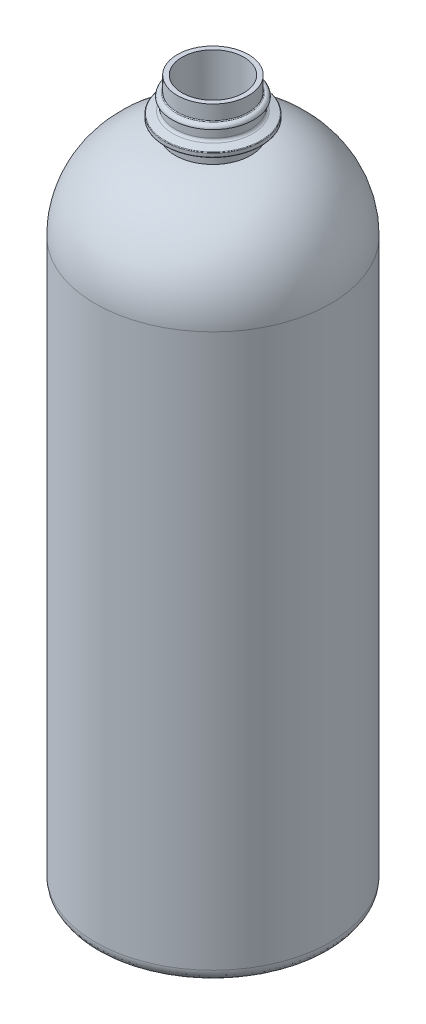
ISO-10303-21;
HEADER;
FILE_DESCRIPTION(('STEP AP214'),'2;1');
FILE_NAME('part.step','',(''),(''),'','','');
FILE_SCHEMA(('AUTOMOTIVE_DESIGN { 1 0 10303 214 1 1 1 1 }'));
ENDSEC;
DATA;
#1=APPLICATION_CONTEXT('core data for automotive mechanical design processes');
#2=APPLICATION_PROTOCOL_DEFINITION('international standard','automotive_design',2000,#1);
#3=PRODUCT_CONTEXT('',#1,'mechanical');
#4=PRODUCT('Part','Part','',(#3));
#5=PRODUCT_RELATED_PRODUCT_CATEGORY('part','',(#4));
#6=PRODUCT_DEFINITION_FORMATION('','',#4);
#7=PRODUCT_DEFINITION_CONTEXT('part definition',#1,'design');
#8=PRODUCT_DEFINITION('design','',#6,#7);
#9=PRODUCT_DEFINITION_SHAPE('','',#8);
#10=(LENGTH_UNIT() NAMED_UNIT(*) SI_UNIT(.MILLI.,.METRE.));
#11=(NAMED_UNIT(*) PLANE_ANGLE_UNIT() SI_UNIT($,.RADIAN.));
#12=(NAMED_UNIT(*) SI_UNIT($,.STERADIAN.) SOLID_ANGLE_UNIT());
#13=UNCERTAINTY_MEASURE_WITH_UNIT(LENGTH_MEASURE(1.E-05),#10,'distance_accuracy_value','');
#14=(GEOMETRIC_REPRESENTATION_CONTEXT(3) GLOBAL_UNCERTAINTY_ASSIGNED_CONTEXT((#13)) GLOBAL_UNIT_ASSIGNED_CONTEXT((#10,
#11,#12)) REPRESENTATION_CONTEXT('',''));
#15=CARTESIAN_POINT('',(0.,0.,0.));
#16=DIRECTION('',(0.,0.,1.));
#17=DIRECTION('',(1.,0.,0.));
#18=AXIS2_PLACEMENT_3D('',#15,#16,#17);
#19=CARTESIAN_POINT('',(0.,233.76763057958,0.));
#20=DIRECTION('',(0.,1.,0.));
#21=DIRECTION('',(-1.,0.,0.));
#22=AXIS2_PLACEMENT_3D('',#19,#20,#21);
#23=TOROIDAL_SURFACE('',#22,14.,0.999999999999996);
#24=CARTESIAN_POINT('',(0.,232.802611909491,0.));
#25=DIRECTION('',(0.,1.,0.));
#26=DIRECTION('',(-1.,0.,0.));
#27=AXIS2_PLACEMENT_3D('',#24,#25,#26);
#28=CIRCLE('',#27,13.7378188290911);
#29=CARTESIAN_POINT('',(-13.7378188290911,232.802611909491,0.));
#30=VERTEX_POINT('',#29);
#31=EDGE_CURVE('E147',#30,#30,#28,.T.);
#32=ORIENTED_EDGE('',*,*,#31,.T.);
#33=EDGE_LOOP('',(#32));
#34=FACE_BOUND('',#33,.T.);
#35=CARTESIAN_POINT('',(0.,233.76763057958,0.));
#36=DIRECTION('',(0.,1.,0.));
#37=DIRECTION('',(-1.,0.,0.));
#38=AXIS2_PLACEMENT_3D('',#35,#36,#37);
#39=CIRCLE('',#38,13.);
#40=CARTESIAN_POINT('',(-13.,233.76763057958,0.));
#41=VERTEX_POINT('',#40);
#42=EDGE_CURVE('E144',#41,#41,#39,.T.);
#43=ORIENTED_EDGE('',*,*,#42,.F.);
#44=EDGE_LOOP('',(#43));
#45=FACE_BOUND('',#44,.T.);
#46=ADVANCED_FACE('F43',(#34,#45),#23,.F.);
#47=CARTESIAN_POINT('',(0.,232.802611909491,0.));
#48=DIRECTION('',(0.,-1.,0.));
#49=DIRECTION('',(1.,0.,0.));
#50=AXIS2_PLACEMENT_3D('',#47,#48,#49);
#51=CONICAL_SURFACE('',#50,13.7378188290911,1.3055145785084);
#52=CARTESIAN_POINT('',(0.,232.075113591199,0.));
#53=DIRECTION('',(0.,1.,0.));
#54=DIRECTION('',(-1.,0.,0.));
#55=AXIS2_PLACEMENT_3D('',#52,#53,#54);
#56=CIRCLE('',#55,16.4155452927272);
#57=CARTESIAN_POINT('',(-16.4155452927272,232.075113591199,0.));
#58=VERTEX_POINT('',#57);
#59=EDGE_CURVE('E150',#58,#58,#56,.T.);
#60=ORIENTED_EDGE('',*,*,#59,.T.);
#61=EDGE_LOOP('',(#60));
#62=FACE_BOUND('',#61,.T.);
#63=ORIENTED_EDGE('',*,*,#31,.F.);
#64=EDGE_LOOP('',(#63));
#65=FACE_BOUND('',#64,.T.);
#66=ADVANCED_FACE('F219',(#62,#65),#51,.T.);
#67=CARTESIAN_POINT('',(0.,231.833858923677,0.));
#68=DIRECTION('',(0.,1.,0.));
#69=DIRECTION('',(-1.,0.,0.));
#70=AXIS2_PLACEMENT_3D('',#67,#68,#69);
#71=TOROIDAL_SURFACE('',#70,16.35,0.249999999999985);
#72=CARTESIAN_POINT('',(0.,231.833858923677,0.));
#73=DIRECTION('',(0.,1.,0.));
#74=DIRECTION('',(-1.,0.,0.));
#75=AXIS2_PLACEMENT_3D('',#72,#73,#74);
#76=CIRCLE('',#75,16.6);
#77=CARTESIAN_POINT('',(-16.6,231.833858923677,0.));
#78=VERTEX_POINT('',#77);
#79=EDGE_CURVE('E153',#78,#78,#76,.T.);
#80=ORIENTED_EDGE('',*,*,#79,.T.);
#81=EDGE_LOOP('',(#80));
#82=FACE_BOUND('',#81,.T.);
#83=ORIENTED_EDGE('',*,*,#59,.F.);
#84=EDGE_LOOP('',(#83));
#85=FACE_BOUND('',#84,.T.);
#86=ADVANCED_FACE('F223',(#82,#85),#71,.T.);
#87=CARTESIAN_POINT('',(0.,243.425,0.));
#88=DIRECTION('',(0.,1.,0.));
#89=DIRECTION('',(-1.,0.,0.));
#90=AXIS2_PLACEMENT_3D('',#87,#88,#89);
#91=CYLINDRICAL_SURFACE('',#90,16.6);
#92=CARTESIAN_POINT('',(0.,230.675,0.));
#93=DIRECTION('',(0.,1.,0.));
#94=DIRECTION('',(-1.,0.,0.));
#95=AXIS2_PLACEMENT_3D('',#92,#93,#94);
#96=CIRCLE('',#95,16.6);
#97=CARTESIAN_POINT('',(-16.6,230.675,0.));
#98=VERTEX_POINT('',#97);
#99=EDGE_CURVE('E156',#98,#98,#96,.T.);
#100=ORIENTED_EDGE('',*,*,#99,.T.);
#101=EDGE_LOOP('',(#100));
#102=FACE_BOUND('',#101,.T.);
#103=ORIENTED_EDGE('',*,*,#79,.F.);
#104=EDGE_LOOP('',(#103));
#105=FACE_BOUND('',#104,.T.);
#106=ADVANCED_FACE('F227',(#102,#105),#91,.T.);
#107=CARTESIAN_POINT('',(0.,230.675,0.));
#108=DIRECTION('',(0.,1.,0.));
#109=DIRECTION('',(-1.,0.,0.));
#110=AXIS2_PLACEMENT_3D('',#107,#108,#109);
#111=TOROIDAL_SURFACE('',#110,16.35,0.250000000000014);
#112=CARTESIAN_POINT('',(0.,230.425,0.));
#113=DIRECTION('',(0.,1.,0.));
#114=DIRECTION('',(-1.,0.,0.));
#115=AXIS2_PLACEMENT_3D('',#112,#113,#114);
#116=CIRCLE('',#115,16.35);
#117=CARTESIAN_POINT('',(-16.35,230.425,0.));
#118=VERTEX_POINT('',#117);
#119=EDGE_CURVE('E159',#118,#118,#116,.T.);
#120=ORIENTED_EDGE('',*,*,#119,.T.);
#121=EDGE_LOOP('',(#120));
#122=FACE_BOUND('',#121,.T.);
#123=ORIENTED_EDGE('',*,*,#99,.F.);
#124=EDGE_LOOP('',(#123));
#125=FACE_BOUND('',#124,.T.);
#126=ADVANCED_FACE('F231',(#122,#125),#111,.T.);
#127=CARTESIAN_POINT('',(-14.,230.425,0.));
#128=DIRECTION('',(0.,-1.,0.));
#129=DIRECTION('',(1.,0.,0.));
#130=AXIS2_PLACEMENT_3D('',#127,#128,#129);
#131=PLANE('',#130);
#132=CARTESIAN_POINT('',(0.,230.425,0.));
#133=DIRECTION('',(0.,1.,0.));
#134=DIRECTION('',(-1.,0.,0.));
#135=AXIS2_PLACEMENT_3D('',#132,#133,#134);
#136=CIRCLE('',#135,14.);
#137=CARTESIAN_POINT('',(-14.,230.425,0.));
#138=VERTEX_POINT('',#137);
#139=EDGE_CURVE('E162',#138,#138,#136,.T.);
#140=ORIENTED_EDGE('',*,*,#139,.T.);
#141=EDGE_LOOP('',(#140));
#142=FACE_BOUND('',#141,.T.);
#143=ORIENTED_EDGE('',*,*,#119,.F.);
#144=EDGE_LOOP('',(#143));
#145=FACE_BOUND('',#144,.T.);
#146=ADVANCED_FACE('F235',(#142,#145),#131,.T.);
#147=CARTESIAN_POINT('',(0.,229.425,0.));
#148=DIRECTION('',(0.,1.,0.));
#149=DIRECTION('',(-1.,0.,0.));
#150=AXIS2_PLACEMENT_3D('',#147,#148,#149);
#151=TOROIDAL_SURFACE('',#150,14.,1.);
#152=CARTESIAN_POINT('',(0.,229.425,0.));
#153=DIRECTION('',(0.,1.,0.));
#154=DIRECTION('',(-1.,0.,0.));
#155=AXIS2_PLACEMENT_3D('',#152,#153,#154);
#156=CIRCLE('',#155,13.);
#157=CARTESIAN_POINT('',(-13.,229.425,0.));
#158=VERTEX_POINT('',#157);
#159=EDGE_CURVE('E165',#158,#158,#156,.T.);
#160=ORIENTED_EDGE('',*,*,#159,.T.);
#161=EDGE_LOOP('',(#160));
#162=FACE_BOUND('',#161,.T.);
#163=ORIENTED_EDGE('',*,*,#139,.F.);
#164=EDGE_LOOP('',(#163));
#165=FACE_BOUND('',#164,.T.);
#166=ADVANCED_FACE('F239',(#162,#165),#151,.F.);
#167=CARTESIAN_POINT('',(0.,243.425,0.));
#168=DIRECTION('',(0.,1.,0.));
#169=DIRECTION('',(-1.,0.,0.));
#170=AXIS2_PLACEMENT_3D('',#167,#168,#169);
#171=CYLINDRICAL_SURFACE('',#170,13.);
#172=CARTESIAN_POINT('',(0.,225.925,0.));
#173=DIRECTION('',(0.,1.,0.));
#174=DIRECTION('',(-1.,0.,0.));
#175=AXIS2_PLACEMENT_3D('',#172,#173,#174);
#176=CIRCLE('',#175,13.);
#177=CARTESIAN_POINT('',(-13.,225.925,0.));
#178=VERTEX_POINT('',#177);
#179=EDGE_CURVE('E51',#178,#178,#176,.F.);
#180=ORIENTED_EDGE('',*,*,#179,.F.);
#181=EDGE_LOOP('',(#180));
#182=FACE_BOUND('',#181,.T.);
#183=ORIENTED_EDGE('',*,*,#159,.F.);
#184=EDGE_LOOP('',(#183));
#185=FACE_BOUND('',#184,.T.);
#186=ADVANCED_FACE('F215',(#182,#185),#171,.T.);
#187=CARTESIAN_POINT('',(0.,243.425,0.));
#188=DIRECTION('',(0.,1.,0.));
#189=DIRECTION('',(-1.,0.,0.));
#190=AXIS2_PLACEMENT_3D('',#187,#188,#189);
#191=CYLINDRICAL_SURFACE('',#190,13.);
#192=ORIENTED_EDGE('',*,*,#42,.T.);
#193=EDGE_LOOP('',(#192));
#194=FACE_BOUND('',#193,.T.);
#195=CARTESIAN_POINT('',(0.,236.91877012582,0.));
#196=DIRECTION('',(0.,1.,0.));
#197=DIRECTION('',(-1.,0.,0.));
#198=AXIS2_PLACEMENT_3D('',#195,#196,#197);
#199=CIRCLE('',#198,13.);
#200=CARTESIAN_POINT('',(-13.,236.91877012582,0.));
#201=VERTEX_POINT('',#200);
#202=EDGE_CURVE('E141',#201,#201,#199,.T.);
#203=ORIENTED_EDGE('',*,*,#202,.F.);
#204=EDGE_LOOP('',(#203));
#205=FACE_BOUND('',#204,.T.);
#206=ADVANCED_FACE('F211',(#194,#205),#191,.T.);
#207=CARTESIAN_POINT('',(0.,236.91877012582,0.));
#208=DIRECTION('',(0.,1.,0.));
#209=DIRECTION('',(-1.,0.,0.));
#210=AXIS2_PLACEMENT_3D('',#207,#208,#209);
#211=TOROIDAL_SURFACE('',#210,13.1,0.0999999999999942);
#212=ORIENTED_EDGE('',*,*,#202,.T.);
#213=EDGE_LOOP('',(#212));
#214=FACE_BOUND('',#213,.T.);
#215=CARTESIAN_POINT('',(0.,237.01877012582,0.));
#216=DIRECTION('',(0.,1.,0.));
#217=DIRECTION('',(-1.,0.,0.));
#218=AXIS2_PLACEMENT_3D('',#215,#216,#217);
#219=CIRCLE('',#218,13.1);
#220=CARTESIAN_POINT('',(-13.1,237.01877012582,0.));
#221=VERTEX_POINT('',#220);
#222=EDGE_CURVE('E138',#221,#221,#219,.T.);
#223=ORIENTED_EDGE('',*,*,#222,.F.);
#224=EDGE_LOOP('',(#223));
#225=FACE_BOUND('',#224,.T.);
#226=ADVANCED_FACE('F207',(#214,#225),#211,.F.);
#227=CARTESIAN_POINT('',(-13.1,237.01877012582,0.));
#228=DIRECTION('',(0.,-1.,0.));
#229=DIRECTION('',(1.,0.,0.));
#230=AXIS2_PLACEMENT_3D('',#227,#228,#229);
#231=PLANE('',#230);
#232=ORIENTED_EDGE('',*,*,#222,.T.);
#233=EDGE_LOOP('',(#232));
#234=FACE_BOUND('',#233,.T.);
#235=CARTESIAN_POINT('',(0.,237.01877012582,0.));
#236=DIRECTION('',(0.,1.,0.));
#237=DIRECTION('',(-1.,0.,0.));
#238=AXIS2_PLACEMENT_3D('',#235,#236,#237);
#239=CIRCLE('',#238,14.);
#240=CARTESIAN_POINT('',(-14.,237.01877012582,0.));
#241=VERTEX_POINT('',#240);
#242=EDGE_CURVE('E135',#241,#241,#239,.T.);
#243=ORIENTED_EDGE('',*,*,#242,.F.);
#244=EDGE_LOOP('',(#243));
#245=FACE_BOUND('',#244,.T.);
#246=ADVANCED_FACE('F203',(#234,#245),#231,.T.);
#247=CARTESIAN_POINT('',(0.,237.01877012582,0.));
#248=DIRECTION('',(0.,1.,0.));
#249=DIRECTION('',(-1.,0.,0.));
#250=AXIS2_PLACEMENT_3D('',#247,#248,#249);
#251=TOROIDAL_SURFACE('',#250,12.7618430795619,1.23815692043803);
#252=ORIENTED_EDGE('',*,*,#242,.T.);
#253=EDGE_LOOP('',(#252));
#254=FACE_BOUND('',#253,.T.);
#255=CARTESIAN_POINT('',(0.,238.237610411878,0.));
#256=DIRECTION('',(0.,1.,0.));
#257=DIRECTION('',(-1.,0.,0.));
#258=AXIS2_PLACEMENT_3D('',#255,#256,#257);
#259=CIRCLE('',#258,12.543987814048);
#260=CARTESIAN_POINT('',(-12.543987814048,238.237610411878,0.));
#261=VERTEX_POINT('',#260);
#262=EDGE_CURVE('E132',#261,#261,#259,.T.);
#263=ORIENTED_EDGE('',*,*,#262,.F.);
#264=EDGE_LOOP('',(#263));
#265=FACE_BOUND('',#264,.T.);
#266=ADVANCED_FACE('F199',(#254,#265),#251,.T.);
#267=CARTESIAN_POINT('',(0.,238.483710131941,0.));
#268=DIRECTION('',(0.,1.,0.));
#269=DIRECTION('',(-1.,0.,0.));
#270=AXIS2_PLACEMENT_3D('',#267,#268,#269);
#271=TOROIDAL_SURFACE('',#270,12.5,0.250000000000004);
#272=ORIENTED_EDGE('',*,*,#262,.T.);
#273=EDGE_LOOP('',(#272));
#274=FACE_BOUND('',#273,.T.);
#275=CARTESIAN_POINT('',(0.,238.483710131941,0.));
#276=DIRECTION('',(0.,1.,0.));
#277=DIRECTION('',(-1.,0.,0.));
#278=AXIS2_PLACEMENT_3D('',#275,#276,#277);
#279=CIRCLE('',#278,12.25);
#280=CARTESIAN_POINT('',(-12.25,238.483710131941,0.));
#281=VERTEX_POINT('',#280);
#282=EDGE_CURVE('E129',#281,#281,#279,.T.);
#283=ORIENTED_EDGE('',*,*,#282,.F.);
#284=EDGE_LOOP('',(#283));
#285=FACE_BOUND('',#284,.T.);
#286=ADVANCED_FACE('F195',(#274,#285),#271,.F.);
#287=CARTESIAN_POINT('',(0.,243.425,0.));
#288=DIRECTION('',(0.,1.,0.));
#289=DIRECTION('',(-1.,0.,0.));
#290=AXIS2_PLACEMENT_3D('',#287,#288,#289);
#291=CYLINDRICAL_SURFACE('',#290,12.25);
#292=ORIENTED_EDGE('',*,*,#282,.T.);
#293=EDGE_LOOP('',(#292));
#294=FACE_BOUND('',#293,.T.);
#295=CARTESIAN_POINT('',(0.,243.425,0.));
#296=DIRECTION('',(0.,1.,0.));
#297=DIRECTION('',(-1.,0.,0.));
#298=AXIS2_PLACEMENT_3D('',#295,#296,#297);
#299=CIRCLE('',#298,12.25);
#300=CARTESIAN_POINT('',(-12.25,243.425,0.));
#301=VERTEX_POINT('',#300);
#302=EDGE_CURVE('E125',#301,#301,#299,.T.);
#303=ORIENTED_EDGE('',*,*,#302,.F.);
#304=EDGE_LOOP('',(#303));
#305=FACE_BOUND('',#304,.T.);
#306=ADVANCED_FACE('F187',(#294,#305),#291,.T.);
#307=CARTESIAN_POINT('',(-12.25,243.425,0.));
#308=DIRECTION('',(0.,1.,0.));
#309=DIRECTION('',(-1.,0.,0.));
#310=AXIS2_PLACEMENT_3D('',#307,#308,#309);
#311=PLANE('',#310);
#312=CARTESIAN_POINT('',(0.,243.425,0.));
#313=DIRECTION('',(0.,1.,0.));
#314=DIRECTION('',(-1.,0.,0.));
#315=AXIS2_PLACEMENT_3D('',#312,#313,#314);
#316=CIRCLE('',#315,10.65);
#317=CARTESIAN_POINT('',(-10.65,243.425,0.));
#318=VERTEX_POINT('',#317);
#319=EDGE_CURVE('E122',#318,#318,#316,.T.);
#320=ORIENTED_EDGE('',*,*,#319,.F.);
#321=EDGE_LOOP('',(#320));
#322=FACE_BOUND('',#321,.T.);
#323=ORIENTED_EDGE('',*,*,#302,.T.);
#324=EDGE_LOOP('',(#323));
#325=FACE_BOUND('',#324,.T.);
#326=ADVANCED_FACE('F181',(#322,#325),#311,.T.);
#327=CARTESIAN_POINT('',(0.,225.425,0.));
#328=DIRECTION('',(0.,1.,0.));
#329=DIRECTION('',(-1.,0.,0.));
#330=AXIS2_PLACEMENT_3D('',#327,#328,#329);
#331=CYLINDRICAL_SURFACE('',#330,10.65);
#332=CARTESIAN_POINT('',(0.,228.353736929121,0.));
#333=DIRECTION('',(0.,-1.,0.));
#334=DIRECTION('',(1.,0.,0.));
#335=AXIS2_PLACEMENT_3D('',#332,#333,#334);
#336=CIRCLE('',#335,10.65);
#337=CARTESIAN_POINT('',(10.65,228.353736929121,0.));
#338=VERTEX_POINT('',#337);
#339=EDGE_CURVE('E12',#338,#338,#336,.T.);
#340=ORIENTED_EDGE('',*,*,#339,.T.);
#341=EDGE_LOOP('',(#340));
#342=FACE_BOUND('',#341,.T.);
#343=ORIENTED_EDGE('',*,*,#319,.T.);
#344=EDGE_LOOP('',(#343));
#345=FACE_BOUND('',#344,.T.);
#346=ADVANCED_FACE('F61',(#342,#345),#331,.F.);
#347=CARTESIAN_POINT('',(-31.,0.00633804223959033,0.));
#348=CARTESIAN_POINT('',(-25.3701015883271,0.00633804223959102,0.));
#349=CARTESIAN_POINT('',(-14.4866541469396,4.05418060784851,0.));
#350=CARTESIAN_POINT('',(-8.70343031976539,7.46263700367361,0.));
#351=CARTESIAN_POINT('',(-7.08228790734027,5.47973382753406,0.));
#352=CARTESIAN_POINT('',(1.68666745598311E-13,7.00000000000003,0.));
#353=B_SPLINE_CURVE_WITH_KNOTS('',3,(#347,#348,#349,#350,#351,#352),.UNSPECIFIED.,.F.,.F.,(4,1,
1,4),(0.,0.638474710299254,0.738474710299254,1.),.UNSPECIFIED.);
#354=CARTESIAN_POINT('',(0.,243.425,0.));
#355=DIRECTION('',(0.,1.,0.));
#356=AXIS1_PLACEMENT('',#354,#355);
#357=SURFACE_OF_REVOLUTION('',#353,#356);
#358=CARTESIAN_POINT('',(1.68666745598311E-13,7.00000000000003,0.));
#359=VERTEX_POINT('',#358);
#360=VERTEX_LOOP('',#359);
#361=FACE_BOUND('',#360,.T.);
#362=CARTESIAN_POINT('',(0.,0.00633804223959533,0.));
#363=DIRECTION('',(0.,1.,0.));
#364=DIRECTION('',(-1.,0.,0.));
#365=AXIS2_PLACEMENT_3D('',#362,#363,#364);
#366=CIRCLE('',#365,31.);
#367=CARTESIAN_POINT('',(-31.,0.00633804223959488,0.));
#368=VERTEX_POINT('',#367);
#369=EDGE_CURVE('E65',#368,#368,#366,.T.);
#370=ORIENTED_EDGE('',*,*,#369,.T.);
#371=EDGE_LOOP('',(#370));
#372=FACE_BOUND('',#371,.T.);
#373=ADVANCED_FACE('F57',(#361,#372),#357,.T.);
#374=CARTESIAN_POINT('',(-40.,5.,0.));
#375=CARTESIAN_POINT('',(-40.,0.237107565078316,0.));
#376=CARTESIAN_POINT('',(-31.,0.00633804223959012,0.));
#377=CARTESIAN_POINT('',(-30.91,0.00403034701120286,0.));
#378=CARTESIAN_POINT('',(-30.82,0.00172265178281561,0.));
#379=B_SPLINE_CURVE_WITH_KNOTS('',2,(#374,#375,#376,#377,#378),.UNSPECIFIED.,.F.,.F.,(3,2,3),
(0.,1.,1.01),.UNSPECIFIED.);
#380=CARTESIAN_POINT('',(0.,243.425,0.));
#381=DIRECTION('',(0.,1.,0.));
#382=AXIS1_PLACEMENT('',#380,#381);
#383=SURFACE_OF_REVOLUTION('',#379,#382);
#384=ORIENTED_EDGE('',*,*,#369,.F.);
#385=EDGE_LOOP('',(#384));
#386=FACE_BOUND('',#385,.T.);
#387=CARTESIAN_POINT('',(0.,5.,0.));
#388=DIRECTION('',(0.,1.,0.));
#389=DIRECTION('',(-1.,0.,0.));
#390=AXIS2_PLACEMENT_3D('',#387,#388,#389);
#391=CIRCLE('',#390,40.);
#392=CARTESIAN_POINT('',(-40.,5.,0.));
#393=VERTEX_POINT('',#392);
#394=EDGE_CURVE('E67',#393,#393,#391,.T.);
#395=ORIENTED_EDGE('',*,*,#394,.T.);
#396=EDGE_LOOP('',(#395));
#397=FACE_BOUND('',#396,.T.);
#398=ADVANCED_FACE('F60',(#386,#397),#383,.T.);
#399=CARTESIAN_POINT('',(0.,243.425,0.));
#400=DIRECTION('',(0.,1.,0.));
#401=DIRECTION('',(-1.,0.,0.));
#402=AXIS2_PLACEMENT_3D('',#399,#400,#401);
#403=CYLINDRICAL_SURFACE('',#402,40.);
#404=ORIENTED_EDGE('',*,*,#394,.F.);
#405=EDGE_LOOP('',(#404));
#406=FACE_BOUND('',#405,.T.);
#407=CARTESIAN_POINT('',(0.,195.425,0.));
#408=DIRECTION('',(0.,1.,0.));
#409=DIRECTION('',(-1.,0.,0.));
#410=AXIS2_PLACEMENT_3D('',#407,#408,#409);
#411=CIRCLE('',#410,40.);
#412=CARTESIAN_POINT('',(-40.,195.425,0.));
#413=VERTEX_POINT('',#412);
#414=EDGE_CURVE('E70',#413,#413,#411,.T.);
#415=ORIENTED_EDGE('',*,*,#414,.T.);
#416=EDGE_LOOP('',(#415));
#417=FACE_BOUND('',#416,.T.);
#418=ADVANCED_FACE('F87',(#406,#417),#403,.F.);
#419=CARTESIAN_POINT('',(0.,195.425,0.));
#420=DIRECTION('',(0.,1.,0.));
#421=DIRECTION('',(-1.,0.,0.));
#422=AXIS2_PLACEMENT_3D('',#419,#420,#421);
#423=DEGENERATE_TOROIDAL_SURFACE('',#422,9.83333333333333,30.1666666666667,.T.);
#424=ORIENTED_EDGE('',*,*,#414,.F.);
#425=EDGE_LOOP('',(#424));
#426=FACE_BOUND('',#425,.T.);
#427=CARTESIAN_POINT('',(0.,225.425,0.));
#428=DIRECTION('',(0.,1.,0.));
#429=DIRECTION('',(-1.,0.,0.));
#430=AXIS2_PLACEMENT_3D('',#427,#428,#429);
#431=CIRCLE('',#430,13.);
#432=CARTESIAN_POINT('',(-13.,225.425,0.));
#433=VERTEX_POINT('',#432);
#434=EDGE_CURVE('E121',#433,#433,#431,.T.);
#435=ORIENTED_EDGE('',*,*,#434,.T.);
#436=EDGE_LOOP('',(#435));
#437=FACE_BOUND('',#436,.T.);
#438=ADVANCED_FACE('F86',(#426,#437),#423,.F.);
#439=CARTESIAN_POINT('',(0.,225.925,0.));
#440=DIRECTION('',(0.,1.,0.));
#441=DIRECTION('',(-1.,0.,0.));
#442=AXIS2_PLACEMENT_3D('',#439,#440,#441);
#443=PLANE('',#442);
#444=ORIENTED_EDGE('',*,*,#179,.T.);
#445=EDGE_LOOP('',(#444));
#446=FACE_BOUND('',#445,.T.);
#447=CARTESIAN_POINT('',(0.,225.925,0.));
#448=DIRECTION('',(0.,1.,0.));
#449=DIRECTION('',(-1.,0.,0.));
#450=AXIS2_PLACEMENT_3D('',#447,#448,#449);
#451=CIRCLE('',#450,13.0262073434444);
#452=CARTESIAN_POINT('',(-13.0262073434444,225.925,0.));
#453=VERTEX_POINT('',#452);
#454=EDGE_CURVE('E75',#453,#453,#451,.T.);
#455=ORIENTED_EDGE('',*,*,#454,.T.);
#456=EDGE_LOOP('',(#455));
#457=FACE_BOUND('',#456,.T.);
#458=ADVANCED_FACE('F91',(#446,#457),#443,.T.);
#459=CARTESIAN_POINT('',(0.,195.425,0.));
#460=DIRECTION('',(0.,1.,0.));
#461=DIRECTION('',(-1.,0.,0.));
#462=AXIS2_PLACEMENT_3D('',#459,#460,#461);
#463=DEGENERATE_TOROIDAL_SURFACE('',#462,9.83333333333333,30.6666666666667,.T.);
#464=CARTESIAN_POINT('',(0.,195.425,0.));
#465=DIRECTION('',(0.,1.,0.));
#466=DIRECTION('',(-1.,0.,0.));
#467=AXIS2_PLACEMENT_3D('',#464,#465,#466);
#468=CIRCLE('',#467,40.5);
#469=CARTESIAN_POINT('',(-40.5,195.425,0.));
#470=VERTEX_POINT('',#469);
#471=EDGE_CURVE('E126',#470,#470,#468,.T.);
#472=ORIENTED_EDGE('',*,*,#471,.T.);
#473=EDGE_LOOP('',(#472));
#474=FACE_BOUND('',#473,.T.);
#475=ORIENTED_EDGE('',*,*,#454,.F.);
#476=EDGE_LOOP('',(#475));
#477=FACE_BOUND('',#476,.T.);
#478=ADVANCED_FACE('F94',(#474,#477),#463,.T.);
#479=CARTESIAN_POINT('',(-31.2641924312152,0.00633804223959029,0.));
#480=CARTESIAN_POINT('',(-31.1761282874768,0.0063380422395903,0.));
#481=CARTESIAN_POINT('',(-31.0880641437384,0.00633804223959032,0.));
#482=CARTESIAN_POINT('',(-25.3701015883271,0.00633804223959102,0.));
#483=CARTESIAN_POINT('',(-14.4866541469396,4.05418060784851,0.));
#484=CARTESIAN_POINT('',(-8.71085264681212,7.45826250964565,0.));
#485=CARTESIAN_POINT('',(-7.09380401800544,5.49377201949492,0.));
#486=CARTESIAN_POINT('',(-0.103841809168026,6.97783100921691,0.));
#487=B_SPLINE_CURVE_WITH_KNOTS('',3,(#479,#480,#481,#482,#483,#484,#485,#486),.UNSPECIFIED.,.F.,
.F.,(4,2,1,1,4),(-0.00998716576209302,0.,0.638474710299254,0.738474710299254,0.998716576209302),.UNSPECIFIED.);
#488=CARTESIAN_POINT('',(0.,243.425,0.));
#489=DIRECTION('',(0.,1.,0.));
#490=AXIS1_PLACEMENT('',#488,#489);
#491=SURFACE_OF_REVOLUTION('',#487,#490);
#492=OFFSET_SURFACE('',#491,-0.5,.F.);
#493=CARTESIAN_POINT('',(0.,6.48873298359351,0.));
#494=VERTEX_POINT('',#493);
#495=VERTEX_LOOP('',#494);
#496=FACE_BOUND('',#495,.T.);
#497=CARTESIAN_POINT('',(-31.0064092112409,-0.49366195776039,0.));
#498=CARTESIAN_POINT('',(-31.0064199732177,-0.493661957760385,0.507341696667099));
#499=CARTESIAN_POINT('',(-30.9939575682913,-0.493661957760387,1.01468247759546));
#500=CARTESIAN_POINT('',(-30.9441636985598,-0.493661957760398,2.02814230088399));
#501=CARTESIAN_POINT('',(-30.9068322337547,-0.493661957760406,2.53426134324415));
#502=CARTESIAN_POINT('',(-30.8073775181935,-0.493661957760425,3.54405778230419));
#503=CARTESIAN_POINT('',(-30.7452542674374,-0.493661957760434,4.04773517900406));
#504=CARTESIAN_POINT('',(-30.5963690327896,-0.493661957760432,5.05143509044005));
#505=CARTESIAN_POINT('',(-30.5096070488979,-0.49366195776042,5.55145760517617));
#506=CARTESIAN_POINT('',(-30.3116524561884,-0.493661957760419,6.54664310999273));
#507=CARTESIAN_POINT('',(-30.2004598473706,-0.493661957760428,7.04180610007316));
#508=CARTESIAN_POINT('',(-29.9539121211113,-0.493661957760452,8.02607967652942));
#509=CARTESIAN_POINT('',(-29.8185570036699,-0.493661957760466,8.51519026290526));
#510=CARTESIAN_POINT('',(-29.5240102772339,-0.493661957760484,9.48618071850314));
#511=CARTESIAN_POINT('',(-29.3648186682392,-0.493661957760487,9.96806058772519));
#512=CARTESIAN_POINT('',(-29.0229824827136,-0.493661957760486,10.9234287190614));
#513=CARTESIAN_POINT('',(-28.8403379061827,-0.493661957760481,11.3969169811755));
#514=CARTESIAN_POINT('',(-28.4520357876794,-0.493661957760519,12.3343612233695));
#515=CARTESIAN_POINT('',(-28.2463782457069,-0.493661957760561,12.7983172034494));
#516=CARTESIAN_POINT('',(-27.8125456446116,-0.4936619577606,13.7155791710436));
#517=CARTESIAN_POINT('',(-27.5843705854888,-0.493661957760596,14.1688851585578));
#518=CARTESIAN_POINT('',(-27.1060526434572,-0.493661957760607,15.0637550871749));
#519=CARTESIAN_POINT('',(-26.8559097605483,-0.493661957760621,15.5053190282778));
#520=CARTESIAN_POINT('',(-26.33425878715,-0.49366195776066,16.3756410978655));
#521=CARTESIAN_POINT('',(-26.0627506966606,-0.493661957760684,16.8043992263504));
#522=CARTESIAN_POINT('',(-25.4990233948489,-0.493661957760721,17.6480767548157));
#523=CARTESIAN_POINT('',(-25.2068041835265,-0.493661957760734,18.0629961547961));
#524=CARTESIAN_POINT('',(-24.6023586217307,-0.493661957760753,18.8779966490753));
#525=CARTESIAN_POINT('',(-24.2901322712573,-0.493661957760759,19.278077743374));
#526=CARTESIAN_POINT('',(-23.6464246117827,-0.493661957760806,20.062437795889));
#527=CARTESIAN_POINT('',(-23.3149433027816,-0.493661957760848,20.4467167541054));
#528=CARTESIAN_POINT('',(-22.6335242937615,-0.493661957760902,21.1985467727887));
#529=CARTESIAN_POINT('',(-22.2835865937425,-0.493661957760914,21.5660978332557));
#530=CARTESIAN_POINT('',(-21.5660978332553,-0.493661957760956,22.2835865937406));
#531=CARTESIAN_POINT('',(-21.1985467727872,-0.493661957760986,22.6335242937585));
#532=CARTESIAN_POINT('',(-20.4467167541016,-0.493661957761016,23.3149433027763));
#533=CARTESIAN_POINT('',(-20.062437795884,-0.493661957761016,23.6464246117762));
#534=CARTESIAN_POINT('',(-19.2780777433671,-0.493661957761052,24.2901322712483));
#535=CARTESIAN_POINT('',(-18.8779966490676,-0.493661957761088,24.6023586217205));
#536=CARTESIAN_POINT('',(-18.0629961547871,-0.493661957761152,25.2068041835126));
#537=CARTESIAN_POINT('',(-17.648076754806,-0.49366195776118,25.4990233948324));
#538=CARTESIAN_POINT('',(-16.8043992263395,-0.493661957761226,26.0627506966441));
#539=CARTESIAN_POINT('',(-16.3756410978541,-0.493661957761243,26.3342587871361));
#540=CARTESIAN_POINT('',(-15.5053190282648,-0.493661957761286,26.8559097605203));
#541=CARTESIAN_POINT('',(-15.0637550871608,-0.493661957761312,27.1060526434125));
#542=CARTESIAN_POINT('',(-14.1688851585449,-0.493661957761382,27.5843705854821));
#543=CARTESIAN_POINT('',(-13.715579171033,-0.493661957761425,27.8125456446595));
#544=CARTESIAN_POINT('',(-12.7983172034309,-0.493661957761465,28.2463782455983));
#545=CARTESIAN_POINT('',(-12.3343612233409,-0.493661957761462,28.4520357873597));
#546=CARTESIAN_POINT('',(-11.3969169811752,-0.493661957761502,28.8403379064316));
#547=CARTESIAN_POINT('',(-10.9234287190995,-0.493661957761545,29.0229824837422));
#548=CARTESIAN_POINT('',(-9.96806058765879,-0.493661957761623,29.36481866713));
#549=CARTESIAN_POINT('',(-9.48618071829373,-0.493661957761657,29.5240102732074));
#550=CARTESIAN_POINT('',(-8.51519026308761,-0.493661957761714,29.8185570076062));
#551=CARTESIAN_POINT('',(-8.02607967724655,-0.493661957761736,29.9539121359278));
#552=CARTESIAN_POINT('',(-7.04180609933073,-0.493661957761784,30.2004598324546));
#553=CARTESIAN_POINT('',(-6.54664310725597,-0.49366195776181,30.3116524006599));
#554=CARTESIAN_POINT('',(-5.55145760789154,-0.493661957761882,30.5096071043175));
#555=CARTESIAN_POINT('',(-5.05143510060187,-0.493661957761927,30.5963692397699));
#556=CARTESIAN_POINT('',(-4.04773516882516,-0.493661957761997,30.7452540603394));
#557=CARTESIAN_POINT('',(-3.54405774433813,-0.493661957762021,30.8073767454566));
#558=CARTESIAN_POINT('',(-2.53426138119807,-0.493661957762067,30.9068330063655));
#559=CARTESIAN_POINT('',(-2.02814244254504,-0.49366195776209,30.9441665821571));
#560=CARTESIAN_POINT('',(-1.01468233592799,-0.493661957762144,30.9939546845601));
#561=CARTESIAN_POINT('',(-0.507341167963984,-0.493661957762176,31.0064092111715));
#562=CARTESIAN_POINT('',(0.507341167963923,-0.493661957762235,31.0064092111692));
#563=CARTESIAN_POINT('',(1.01468233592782,-0.493661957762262,30.9939546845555));
#564=CARTESIAN_POINT('',(2.02814244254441,-0.493661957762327,30.9441665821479));
#565=CARTESIAN_POINT('',(2.5342613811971,-0.493661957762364,30.9068330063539));
#566=CARTESIAN_POINT('',(3.54405774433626,-0.493661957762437,30.8073767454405));
#567=CARTESIAN_POINT('',(4.04773516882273,-0.493661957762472,30.7452540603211));
#568=CARTESIAN_POINT('',(5.05143510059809,-0.493661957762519,30.5963692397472));
#569=CARTESIAN_POINT('',(5.55145760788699,-0.493661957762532,30.5096071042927));
#570=CARTESIAN_POINT('',(6.54664310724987,-0.493661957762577,30.3116524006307));
#571=CARTESIAN_POINT('',(7.04180609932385,-0.493661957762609,30.2004598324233));
#572=CARTESIAN_POINT('',(8.02607967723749,-0.493661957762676,29.9539121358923));
#573=CARTESIAN_POINT('',(8.51519026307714,-0.493661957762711,29.8185570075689));
#574=CARTESIAN_POINT('',(9.48618071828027,-0.493661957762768,29.5240102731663));
#575=CARTESIAN_POINT('',(9.96806058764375,-0.49366195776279,29.3648186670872));
#576=CARTESIAN_POINT('',(10.9234287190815,-0.493661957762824,29.0229824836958));
#577=CARTESIAN_POINT('',(11.3969169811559,-0.493661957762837,28.8403379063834));
#578=CARTESIAN_POINT('',(12.3343612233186,-0.493661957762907,28.4520357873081));
#579=CARTESIAN_POINT('',(12.798317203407,-0.493661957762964,28.2463782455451));
#580=CARTESIAN_POINT('',(13.7155791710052,-0.493661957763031,27.8125456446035));
#581=CARTESIAN_POINT('',(14.1688851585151,-0.493661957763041,27.5843705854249));
#582=CARTESIAN_POINT('',(15.063755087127,-0.493661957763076,27.1060526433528));
#583=CARTESIAN_POINT('',(15.5053190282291,-0.493661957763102,26.8559097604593));
#584=CARTESIAN_POINT('',(16.3756410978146,-0.49366195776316,26.3342587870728));
#585=CARTESIAN_POINT('',(16.804399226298,-0.493661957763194,26.0627506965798));
#586=CARTESIAN_POINT('',(17.6480767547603,-0.493661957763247,25.4990233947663));
#587=CARTESIAN_POINT('',(18.0629961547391,-0.493661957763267,25.2068041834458));
#588=CARTESIAN_POINT('',(18.8779966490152,-0.493661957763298,24.6023586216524));
#589=CARTESIAN_POINT('',(19.2780777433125,-0.493661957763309,24.2901322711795));
#590=CARTESIAN_POINT('',(20.0624377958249,-0.493661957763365,23.6464246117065));
#591=CARTESIAN_POINT('',(20.44671675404,-0.49366195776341,23.3149433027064));
#592=CARTESIAN_POINT('',(21.1985467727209,-0.493661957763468,22.6335242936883));
#593=CARTESIAN_POINT('',(21.5660978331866,-0.493661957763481,22.2835865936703));
#594=CARTESIAN_POINT('',(22.2835865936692,-0.493661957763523,21.5660978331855));
#595=CARTESIAN_POINT('',(22.6335242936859,-0.493661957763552,21.1985467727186));
#596=CARTESIAN_POINT('',(23.3149433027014,-0.493661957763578,20.4467167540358));
#597=CARTESIAN_POINT('',(23.6464246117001,-0.493661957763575,20.0624377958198));
#598=CARTESIAN_POINT('',(24.2901322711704,-0.493661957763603,19.2780777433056));
#599=CARTESIAN_POINT('',(24.6023586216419,-0.493661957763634,18.8779966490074));
#600=CARTESIAN_POINT('',(25.2068041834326,-0.493661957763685,18.0629961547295));
#601=CARTESIAN_POINT('',(25.4990233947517,-0.493661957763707,17.6480767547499));
#602=CARTESIAN_POINT('',(26.0627506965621,-0.493661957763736,16.8043992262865));
#603=CARTESIAN_POINT('',(26.3342587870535,-0.493661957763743,16.3756410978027));
#604=CARTESIAN_POINT('',(26.8559097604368,-0.493661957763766,15.5053190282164));
#605=CARTESIAN_POINT('',(27.1060526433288,-0.493661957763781,15.0637550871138));
#606=CARTESIAN_POINT('',(27.5843705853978,-0.493661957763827,14.1688851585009));
#607=CARTESIAN_POINT('',(27.8125456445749,-0.493661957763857,13.7155791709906));
#608=CARTESIAN_POINT('',(28.2463782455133,-0.493661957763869,12.798317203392));
#609=CARTESIAN_POINT('',(28.4520357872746,-0.49366195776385,12.3343612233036));
#610=CARTESIAN_POINT('',(28.8403379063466,-0.493661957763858,11.396916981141));
#611=CARTESIAN_POINT('',(29.0229824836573,-0.493661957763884,10.9234287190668));
#612=CARTESIAN_POINT('',(29.3648186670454,-0.493661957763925,9.96806058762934));
#613=CARTESIAN_POINT('',(29.5240102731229,-0.493661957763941,9.48618071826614));
#614=CARTESIAN_POINT('',(29.8185570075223,-0.493661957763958,8.51519026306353));
#615=CARTESIAN_POINT('',(29.9539121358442,-0.49366195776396,8.02607967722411));
#616=CARTESIAN_POINT('',(30.200459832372,-0.493661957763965,7.04180609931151));
#617=CARTESIAN_POINT('',(30.3116524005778,-0.493661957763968,6.54664310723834));
#618=CARTESIAN_POINT('',(30.5096071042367,-0.493661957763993,5.55145760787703));
#619=CARTESIAN_POINT('',(30.5963692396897,-0.493661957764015,5.05143510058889));
#620=CARTESIAN_POINT('',(30.7452540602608,-0.493661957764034,4.04773516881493));
#621=CARTESIAN_POINT('',(30.8073767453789,-0.493661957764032,3.54405774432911));
#622=CARTESIAN_POINT('',(30.9068330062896,-0.493661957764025,2.53426138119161));
#623=CARTESIAN_POINT('',(30.9441665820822,-0.49366195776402,2.02814244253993));
#624=CARTESIAN_POINT('',(30.9939546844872,-0.493661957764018,1.0146823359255));
#625=CARTESIAN_POINT('',(31.0064092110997,-0.493661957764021,0.507341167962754));
#626=CARTESIAN_POINT('',(31.0064092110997,-0.493661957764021,-0.507341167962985));
#627=CARTESIAN_POINT('',(30.9939546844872,-0.493661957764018,-1.01468233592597));
#628=CARTESIAN_POINT('',(30.9441665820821,-0.49366195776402,-2.0281424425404));
#629=CARTESIAN_POINT('',(30.9068330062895,-0.493661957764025,-2.53426138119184));
#630=CARTESIAN_POINT('',(30.8073767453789,-0.493661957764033,-3.54405774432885));
#631=CARTESIAN_POINT('',(30.7452540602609,-0.493661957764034,-4.04773516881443));
#632=CARTESIAN_POINT('',(30.5963692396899,-0.493661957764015,-5.05143510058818));
#633=CARTESIAN_POINT('',(30.5096071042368,-0.493661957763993,-5.55145760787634));
#634=CARTESIAN_POINT('',(30.3116524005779,-0.493661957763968,-6.54664310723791));
#635=CARTESIAN_POINT('',(30.200459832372,-0.493661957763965,-7.04180609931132));
#636=CARTESIAN_POINT('',(29.9539121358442,-0.49366195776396,-8.02607967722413));
#637=CARTESIAN_POINT('',(29.8185570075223,-0.493661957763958,-8.51519026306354));
#638=CARTESIAN_POINT('',(29.5240102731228,-0.493661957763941,-9.48618071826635));
#639=CARTESIAN_POINT('',(29.3648186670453,-0.493661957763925,-9.96806058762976));
#640=CARTESIAN_POINT('',(29.0229824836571,-0.493661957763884,-10.9234287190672));
#641=CARTESIAN_POINT('',(28.8403379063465,-0.493661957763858,-11.3969169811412));
#642=CARTESIAN_POINT('',(28.4520357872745,-0.49366195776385,-12.3343612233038));
#643=CARTESIAN_POINT('',(28.2463782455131,-0.493661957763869,-12.7983172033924));
#644=CARTESIAN_POINT('',(27.8125456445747,-0.493661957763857,-13.715579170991));
#645=CARTESIAN_POINT('',(27.5843705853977,-0.493661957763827,-14.1688851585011));
#646=CARTESIAN_POINT('',(27.1060526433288,-0.493661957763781,-15.0637550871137));
#647=CARTESIAN_POINT('',(26.8559097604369,-0.493661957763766,-15.5053190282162));
#648=CARTESIAN_POINT('',(26.3342587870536,-0.493661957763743,-16.3756410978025));
#649=CARTESIAN_POINT('',(26.0627506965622,-0.493661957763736,-16.8043992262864));
#650=CARTESIAN_POINT('',(25.4990233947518,-0.493661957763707,-17.6480767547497));
#651=CARTESIAN_POINT('',(25.2068041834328,-0.493661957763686,-18.0629961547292));
#652=CARTESIAN_POINT('',(24.6023586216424,-0.493661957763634,-18.8779966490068));
#653=CARTESIAN_POINT('',(24.2901322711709,-0.493661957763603,-19.278077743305));
#654=CARTESIAN_POINT('',(23.6464246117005,-0.493661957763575,-20.0624377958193));
#655=CARTESIAN_POINT('',(23.3149433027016,-0.493661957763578,-20.4467167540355));
#656=CARTESIAN_POINT('',(22.6335242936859,-0.493661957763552,-21.1985467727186));
#657=CARTESIAN_POINT('',(22.2835865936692,-0.493661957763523,-21.5660978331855));
#658=CARTESIAN_POINT('',(21.5660978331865,-0.493661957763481,-22.2835865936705));
#659=CARTESIAN_POINT('',(21.1985467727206,-0.493661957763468,-22.6335242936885));
#660=CARTESIAN_POINT('',(20.4467167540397,-0.49366195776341,-23.3149433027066));
#661=CARTESIAN_POINT('',(20.0624377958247,-0.493661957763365,-23.6464246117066));
#662=CARTESIAN_POINT('',(19.2780777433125,-0.493661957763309,-24.2901322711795));
#663=CARTESIAN_POINT('',(18.8779966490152,-0.493661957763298,-24.6023586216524));
#664=CARTESIAN_POINT('',(18.0629961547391,-0.493661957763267,-25.2068041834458));
#665=CARTESIAN_POINT('',(17.6480767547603,-0.493661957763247,-25.4990233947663));
#666=CARTESIAN_POINT('',(16.804399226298,-0.493661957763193,-26.0627506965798));
#667=CARTESIAN_POINT('',(16.3756410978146,-0.49366195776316,-26.3342587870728));
#668=CARTESIAN_POINT('',(15.5053190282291,-0.493661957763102,-26.8559097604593));
#669=CARTESIAN_POINT('',(15.063755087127,-0.493661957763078,-27.1060526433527));
#670=CARTESIAN_POINT('',(14.1688851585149,-0.493661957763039,-27.5843705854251));
#671=CARTESIAN_POINT('',(13.715579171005,-0.493661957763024,-27.812545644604));
#672=CARTESIAN_POINT('',(12.7983172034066,-0.493661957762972,-28.246378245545));
#673=CARTESIAN_POINT('',(12.3343612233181,-0.493661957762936,-28.4520357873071));
#674=CARTESIAN_POINT('',(11.3969169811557,-0.493661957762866,-28.8403379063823));
#675=CARTESIAN_POINT('',(10.9234287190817,-0.493661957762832,-29.0229824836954));
#676=CARTESIAN_POINT('',(9.96806058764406,-0.493661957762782,-29.3648186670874));
#677=CARTESIAN_POINT('',(9.48618071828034,-0.493661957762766,-29.5240102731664));
#678=CARTESIAN_POINT('',(8.51519026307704,-0.493661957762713,-29.8185570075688));
#679=CARTESIAN_POINT('',(8.02607967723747,-0.493661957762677,-29.9539121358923));
#680=CARTESIAN_POINT('',(7.04180609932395,-0.493661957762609,-30.2004598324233));
#681=CARTESIAN_POINT('',(6.54664310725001,-0.493661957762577,-30.3116524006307));
#682=CARTESIAN_POINT('',(5.551457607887,-0.493661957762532,-30.5096071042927));
#683=CARTESIAN_POINT('',(5.05143510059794,-0.493661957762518,-30.5963692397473));
#684=CARTESIAN_POINT('',(4.04773516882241,-0.49366195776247,-30.7452540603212));
#685=CARTESIAN_POINT('',(3.54405774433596,-0.493661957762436,-30.8073767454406));
#686=CARTESIAN_POINT('',(2.53426138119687,-0.493661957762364,-30.906833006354));
#687=CARTESIAN_POINT('',(2.02814244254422,-0.493661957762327,-30.9441665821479));
#688=CARTESIAN_POINT('',(1.01468233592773,-0.493661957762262,-30.9939546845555));
#689=CARTESIAN_POINT('',(0.507341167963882,-0.493661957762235,-31.0064092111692));
#690=CARTESIAN_POINT('',(-0.507341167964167,-0.493661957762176,-31.0064092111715));
#691=CARTESIAN_POINT('',(-1.01468233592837,-0.493661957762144,-30.9939546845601));
#692=CARTESIAN_POINT('',(-2.02814244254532,-0.49366195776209,-30.944166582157));
#693=CARTESIAN_POINT('',(-2.53426138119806,-0.493661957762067,-30.9068330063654));
#694=CARTESIAN_POINT('',(-3.54405774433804,-0.493661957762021,-30.8073767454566));
#695=CARTESIAN_POINT('',(-4.04773516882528,-0.493661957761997,-30.7452540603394));
#696=CARTESIAN_POINT('',(-5.0514351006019,-0.493661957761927,-30.5963692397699));
#697=CARTESIAN_POINT('',(-5.5514576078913,-0.493661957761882,-30.5096071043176));
#698=CARTESIAN_POINT('',(-6.54664310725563,-0.49366195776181,-30.31165240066));
#699=CARTESIAN_POINT('',(-7.04180609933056,-0.493661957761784,-30.2004598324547));
#700=CARTESIAN_POINT('',(-8.02607967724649,-0.493661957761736,-29.9539121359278));
#701=CARTESIAN_POINT('',(-8.51519026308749,-0.493661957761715,-29.8185570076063));
#702=CARTESIAN_POINT('',(-9.48618071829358,-0.493661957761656,-29.5240102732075));
#703=CARTESIAN_POINT('',(-9.96806058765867,-0.49366195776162,-29.3648186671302));
#704=CARTESIAN_POINT('',(-10.9234287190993,-0.493661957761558,-29.0229824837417));
#705=CARTESIAN_POINT('',(-11.3969169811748,-0.493661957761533,-28.8403379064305));
#706=CARTESIAN_POINT('',(-12.3343612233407,-0.49366195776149,-28.4520357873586));
#707=CARTESIAN_POINT('',(-12.798317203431,-0.493661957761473,-28.2463782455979));
#708=CARTESIAN_POINT('',(-13.7155791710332,-0.493661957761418,-27.8125456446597));
#709=CARTESIAN_POINT('',(-14.1688851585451,-0.49366195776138,-27.5843705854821));
#710=CARTESIAN_POINT('',(-15.0637550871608,-0.493661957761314,-27.1060526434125));
#711=CARTESIAN_POINT('',(-15.5053190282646,-0.493661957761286,-26.8559097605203));
#712=CARTESIAN_POINT('',(-16.375641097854,-0.493661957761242,-26.3342587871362));
#713=CARTESIAN_POINT('',(-16.8043992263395,-0.493661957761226,-26.0627506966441));
#714=CARTESIAN_POINT('',(-17.648076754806,-0.493661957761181,-25.4990233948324));
#715=CARTESIAN_POINT('',(-18.062996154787,-0.493661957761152,-25.2068041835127));
#716=CARTESIAN_POINT('',(-18.8779966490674,-0.493661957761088,-24.6023586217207));
#717=CARTESIAN_POINT('',(-19.2780777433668,-0.493661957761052,-24.2901322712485));
#718=CARTESIAN_POINT('',(-20.0624377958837,-0.493661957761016,-23.6464246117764));
#719=CARTESIAN_POINT('',(-20.4467167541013,-0.493661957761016,-23.3149433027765));
#720=CARTESIAN_POINT('',(-21.1985467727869,-0.493661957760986,-22.6335242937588));
#721=CARTESIAN_POINT('',(-21.566097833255,-0.493661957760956,-22.2835865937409));
#722=CARTESIAN_POINT('',(-22.2835865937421,-0.493661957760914,-21.5660978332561));
#723=CARTESIAN_POINT('',(-22.6335242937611,-0.493661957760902,-21.1985467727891));
#724=CARTESIAN_POINT('',(-23.3149433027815,-0.493661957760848,-20.4467167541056));
#725=CARTESIAN_POINT('',(-23.6464246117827,-0.493661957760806,-20.062437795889));
#726=CARTESIAN_POINT('',(-24.2901322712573,-0.493661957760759,-19.2780777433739));
#727=CARTESIAN_POINT('',(-24.6023586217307,-0.493661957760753,-18.8779966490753));
#728=CARTESIAN_POINT('',(-25.2068041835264,-0.493661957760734,-18.0629961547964));
#729=CARTESIAN_POINT('',(-25.4990233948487,-0.493661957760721,-17.648076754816));
#730=CARTESIAN_POINT('',(-26.0627506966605,-0.493661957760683,-16.8043992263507));
#731=CARTESIAN_POINT('',(-26.3342587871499,-0.493661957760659,-16.3756410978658));
#732=CARTESIAN_POINT('',(-26.8559097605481,-0.493661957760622,-15.505319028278));
#733=CARTESIAN_POINT('',(-27.106052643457,-0.493661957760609,-15.0637550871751));
#734=CARTESIAN_POINT('',(-27.5843705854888,-0.493661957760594,-14.1688851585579));
#735=CARTESIAN_POINT('',(-27.8125456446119,-0.493661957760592,-13.7155791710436));
#736=CARTESIAN_POINT('',(-28.2463782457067,-0.493661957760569,-12.7983172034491));
#737=CARTESIAN_POINT('',(-28.4520357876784,-0.493661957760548,-12.3343612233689));
#738=CARTESIAN_POINT('',(-28.8403379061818,-0.49366195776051,-11.3969169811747));
#739=CARTESIAN_POINT('',(-29.0229824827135,-0.493661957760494,-10.9234287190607));
#740=CARTESIAN_POINT('',(-29.3648186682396,-0.493661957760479,-9.96806058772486));
#741=CARTESIAN_POINT('',(-29.524010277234,-0.493661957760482,-9.48618071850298));
#742=CARTESIAN_POINT('',(-29.8185570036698,-0.493661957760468,-8.51519026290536));
#743=CARTESIAN_POINT('',(-29.9539121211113,-0.493661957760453,-8.02607967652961));
#744=CARTESIAN_POINT('',(-30.2004598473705,-0.493661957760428,-7.04180610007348));
#745=CARTESIAN_POINT('',(-30.3116524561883,-0.493661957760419,-6.54664310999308));
#746=CARTESIAN_POINT('',(-30.5096070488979,-0.49366195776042,-5.55145760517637));
#747=CARTESIAN_POINT('',(-30.5963690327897,-0.493661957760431,-5.05143509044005));
#748=CARTESIAN_POINT('',(-30.7452542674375,-0.493661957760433,-4.04773517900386));
#749=CARTESIAN_POINT('',(-30.8073775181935,-0.493661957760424,-3.54405778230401));
#750=CARTESIAN_POINT('',(-30.9068322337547,-0.493661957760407,-2.53426134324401));
#751=CARTESIAN_POINT('',(-30.9441636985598,-0.493661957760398,-2.02814230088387));
#752=CARTESIAN_POINT('',(-30.9939575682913,-0.493661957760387,-1.0146824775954));
#753=CARTESIAN_POINT('',(-31.0064199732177,-0.493661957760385,-0.507341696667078));
#754=CARTESIAN_POINT('',(-31.0064092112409,-0.49366195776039,0.));
#755=B_SPLINE_CURVE_WITH_KNOTS('',3,(#497,#498,#499,#500,#501,#502,#503,#504,#505,#506,#507,
#508,#509,#510,#511,#512,#513,#514,#515,#516,#517,#518,#519,#520,#521,#522,#523,#524,#525,#526,
#527,#528,#529,#530,#531,#532,#533,#534,#535,#536,#537,#538,#539,#540,#541,#542,#543,#544,#545,
#546,#547,#548,#549,#550,#551,#552,#553,#554,#555,#556,#557,#558,#559,#560,#561,#562,#563,#564,
#565,#566,#567,#568,#569,#570,#571,#572,#573,#574,#575,#576,#577,#578,#579,#580,#581,#582,#583,
#584,#585,#586,#587,#588,#589,#590,#591,#592,#593,#594,#595,#596,#597,#598,#599,#600,#601,#602,
#603,#604,#605,#606,#607,#608,#609,#610,#611,#612,#613,#614,#615,#616,#617,#618,#619,#620,#621,
#622,#623,#624,#625,#626,#627,#628,#629,#630,#631,#632,#633,#634,#635,#636,#637,#638,#639,#640,
#641,#642,#643,#644,#645,#646,#647,#648,#649,#650,#651,#652,#653,#654,#655,#656,#657,#658,#659,
#660,#661,#662,#663,#664,#665,#666,#667,#668,#669,#670,#671,#672,#673,#674,#675,#676,#677,#678,
#679,#680,#681,#682,#683,#684,#685,#686,#687,#688,#689,#690,#691,#692,#693,#694,#695,#696,#697,
#698,#699,#700,#701,#702,#703,#704,#705,#706,#707,#708,#709,#710,#711,#712,#713,#714,#715,#716,
#717,#718,#719,#720,#721,#722,#723,#724,#725,#726,#727,#728,#729,#730,#731,#732,#733,#734,#735,
#736,#737,#738,#739,#740,#741,#742,#743,#744,#745,#746,#747,#748,#749,#750,#751,#752,#753,#754),
.UNSPECIFIED.,.F.,.F.,(4,2,2,2,2,2,2,2,2,2,2,2,2,2,2,2,2,2,2,2,2,2,2,2,2,2,2,2,2,2,2,2,2,2,2,2,
2,2,2,2,2,2,2,2,2,2,2,2,2,2,2,2,2,2,2,2,2,2,2,2,2,2,2,2,2,2,2,2,2,2,2,2,2,2,2,2,2,2,2,2,2,2,2,2,
2,2,2,2,2,2,2,2,2,2,2,2,2,2,2,2,2,2,2,2,2,2,2,2,2,2,2,2,2,2,2,2,2,2,2,2,2,2,2,2,2,2,2,2,4),(0.,
1.5218707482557,3.04374149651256,4.56561224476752,6.08748299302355,7.6093537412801,
9.1312244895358,10.6530952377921,12.1749659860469,13.6968367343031,15.2187074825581,
16.7405782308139,18.2624489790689,19.7843197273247,21.3061904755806,22.8280612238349,
24.3499319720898,25.8718027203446,27.3936734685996,28.9155442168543,30.4374149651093,
31.9592857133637,33.481156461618,35.0030272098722,36.5248979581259,38.0467687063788,
39.5686394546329,41.0905102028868,42.6123809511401,44.1342516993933,45.6561224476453,
47.177993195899,48.6998639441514,50.2217346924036,51.7436054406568,53.265476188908,
54.78734693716,56.3092176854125,57.8310884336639,59.3529591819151,60.8748299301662,
62.3967006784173,63.9185714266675,65.4404421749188,66.9623129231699,68.4841836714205,
70.0060544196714,71.5279251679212,73.0497959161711,74.571666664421,76.0935374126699,
77.6154081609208,79.1372789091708,80.6591496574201,82.1810204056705,83.7028911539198,
85.2247619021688,86.7466326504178,88.2685033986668,89.7903741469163,91.3122448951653,
92.8341156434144,94.3559863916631,95.8778571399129,97.3997278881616,98.921598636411,
100.44346938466,101.965340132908,103.487210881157,105.009081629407,106.530952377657,
108.052823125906,109.574693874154,111.096564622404,112.618435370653,114.140306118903,
115.662176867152,117.184047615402,118.705918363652,120.227789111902,121.749659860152,
123.271530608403,124.793401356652,126.315272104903,127.837142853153,129.359013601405,
130.880884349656,132.402755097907,133.924625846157,135.446496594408,136.96836734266,
138.490238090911,140.012108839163,141.533979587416,143.055850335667,144.57772108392,
146.099591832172,147.621462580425,149.143333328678,150.66520407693,152.187074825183,
153.708945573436,155.23081632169,156.752687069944,158.274557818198,159.796428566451,
161.318299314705,162.840170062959,164.362040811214,165.883911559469,167.405782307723,
168.927653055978,170.449523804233,171.971394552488,173.493265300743,175.015136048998,
176.537006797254,178.058877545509,179.580748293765,181.10261904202,182.624489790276,
184.146360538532,185.668231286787,187.190102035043,188.711972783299,190.233843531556,
191.755714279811,193.277585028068,194.799455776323),.UNSPECIFIED.);
#756=CARTESIAN_POINT('',(-31.0064092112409,-0.49366195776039,0.));
#757=VERTEX_POINT('',#756);
#758=EDGE_CURVE('E281',#757,#757,#755,.T.);
#759=ORIENTED_EDGE('',*,*,#758,.F.);
#760=EDGE_LOOP('',(#759));
#761=FACE_BOUND('',#760,.T.);
#762=ADVANCED_FACE('F98',(#496,#761),#492,.F.);
#763=CARTESIAN_POINT('',(-40.,5.,0.));
#764=CARTESIAN_POINT('',(-40.,0.237107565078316,0.));
#765=CARTESIAN_POINT('',(-30.91,0.00403034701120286,0.));
#766=CARTESIAN_POINT('',(-30.82,0.00172265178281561,0.));
#767=B_SPLINE_CURVE_WITH_KNOTS('',2,(#763,#764,#765,#766),.UNSPECIFIED.,.F.,.F.,(3,1,3),(0.,1.,
1.01),.UNSPECIFIED.);
#768=CARTESIAN_POINT('',(0.,243.425,0.));
#769=DIRECTION('',(0.,1.,0.));
#770=AXIS1_PLACEMENT('',#768,#769);
#771=SURFACE_OF_REVOLUTION('',#767,#770);
#772=OFFSET_SURFACE('',#771,-0.5,.F.);
#773=ORIENTED_EDGE('',*,*,#758,.T.);
#774=EDGE_LOOP('',(#773));
#775=FACE_BOUND('',#774,.T.);
#776=CARTESIAN_POINT('',(0.,5.,0.));
#777=DIRECTION('',(0.,1.,0.));
#778=DIRECTION('',(-1.,0.,0.));
#779=AXIS2_PLACEMENT_3D('',#776,#777,#778);
#780=CIRCLE('',#779,40.5);
#781=CARTESIAN_POINT('',(-40.5,5.,0.));
#782=VERTEX_POINT('',#781);
#783=EDGE_CURVE('E283',#782,#782,#780,.T.);
#784=ORIENTED_EDGE('',*,*,#783,.F.);
#785=EDGE_LOOP('',(#784));
#786=FACE_BOUND('',#785,.T.);
#787=ADVANCED_FACE('F103',(#775,#786),#772,.F.);
#788=CARTESIAN_POINT('',(0.,243.425,0.));
#789=DIRECTION('',(0.,1.,0.));
#790=DIRECTION('',(-1.,0.,0.));
#791=AXIS2_PLACEMENT_3D('',#788,#789,#790);
#792=CYLINDRICAL_SURFACE('',#791,40.5);
#793=ORIENTED_EDGE('',*,*,#783,.T.);
#794=EDGE_LOOP('',(#793));
#795=FACE_BOUND('',#794,.T.);
#796=ORIENTED_EDGE('',*,*,#471,.F.);
#797=EDGE_LOOP('',(#796));
#798=FACE_BOUND('',#797,.T.);
#799=ADVANCED_FACE('F172',(#795,#798),#792,.T.);
#800=CARTESIAN_POINT('',(0.,228.353736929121,0.));
#801=DIRECTION('',(0.,-1.,0.));
#802=DIRECTION('',(1.,0.,0.));
#803=AXIS2_PLACEMENT_3D('',#800,#801,#802);
#804=TOROIDAL_SURFACE('',#803,13.65,3.);
#805=ORIENTED_EDGE('',*,*,#339,.F.);
#806=EDGE_LOOP('',(#805));
#807=FACE_BOUND('',#806,.T.);
#808=ORIENTED_EDGE('',*,*,#434,.F.);
#809=EDGE_LOOP('',(#808));
#810=FACE_BOUND('',#809,.T.);
#811=ADVANCED_FACE('F45',(#807,#810),#804,.T.);
#812=CLOSED_SHELL('',(#46,#66,#86,#106,#126,#146,#166,#186,#206,#226,#246,#266,#286,#306,#326,
#346,#373,#398,#418,#438,#458,#478,#762,#787,#799,#811));
#813=MANIFOLD_SOLID_BREP('B2',#812);
#814=ADVANCED_BREP_SHAPE_REPRESENTATION('',(#18,#813),#14);
#815=SHAPE_DEFINITION_REPRESENTATION(#9,#814);
ENDSEC;
END-ISO-10303-21;
